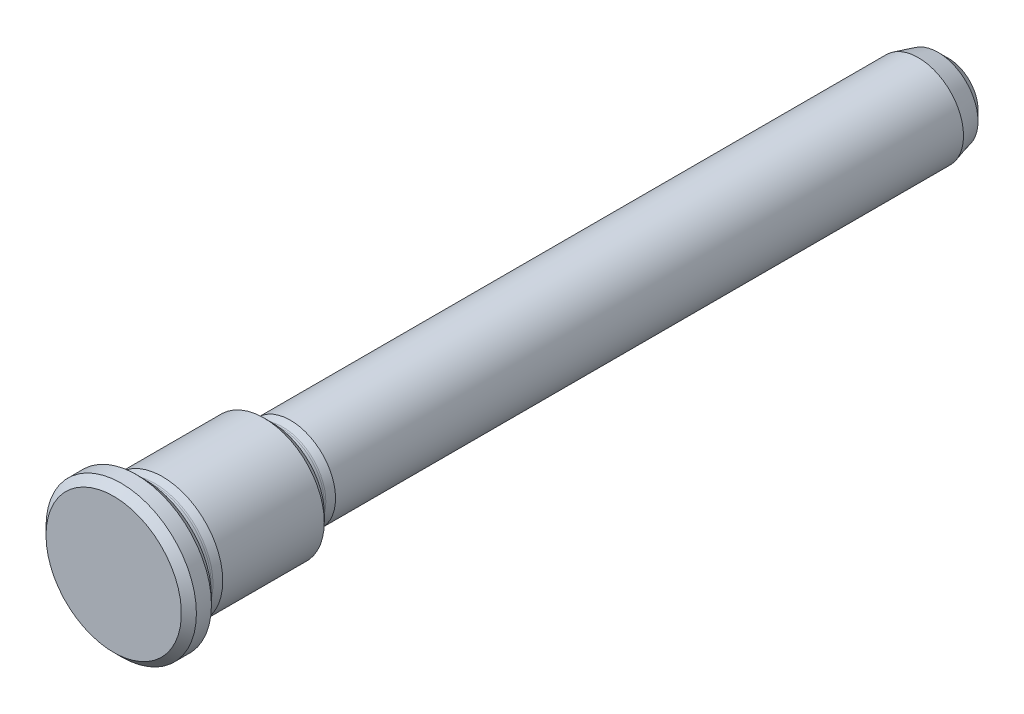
ISO-10303-21;
HEADER;
FILE_DESCRIPTION(('STEP AP214'),'2;1');
FILE_NAME('part.step','',(''),(''),'','','');
FILE_SCHEMA(('AUTOMOTIVE_DESIGN { 1 0 10303 214 1 1 1 1 }'));
ENDSEC;
DATA;
#1=APPLICATION_CONTEXT('core data for automotive mechanical design processes');
#2=APPLICATION_PROTOCOL_DEFINITION('international standard','automotive_design',2000,#1);
#3=PRODUCT_CONTEXT('',#1,'mechanical');
#4=PRODUCT('Part','Part','',(#3));
#5=PRODUCT_RELATED_PRODUCT_CATEGORY('part','',(#4));
#6=PRODUCT_DEFINITION_FORMATION('','',#4);
#7=PRODUCT_DEFINITION_CONTEXT('part definition',#1,'design');
#8=PRODUCT_DEFINITION('design','',#6,#7);
#9=PRODUCT_DEFINITION_SHAPE('','',#8);
#10=(LENGTH_UNIT() NAMED_UNIT(*) SI_UNIT(.MILLI.,.METRE.));
#11=(NAMED_UNIT(*) PLANE_ANGLE_UNIT() SI_UNIT($,.RADIAN.));
#12=(NAMED_UNIT(*) SI_UNIT($,.STERADIAN.) SOLID_ANGLE_UNIT());
#13=UNCERTAINTY_MEASURE_WITH_UNIT(LENGTH_MEASURE(1.E-05),#10,'distance_accuracy_value','');
#14=(GEOMETRIC_REPRESENTATION_CONTEXT(3) GLOBAL_UNCERTAINTY_ASSIGNED_CONTEXT((#13)) GLOBAL_UNIT_ASSIGNED_CONTEXT((#10,
#11,#12)) REPRESENTATION_CONTEXT('',''));
#15=CARTESIAN_POINT('',(0.,0.,0.));
#16=DIRECTION('',(0.,0.,1.));
#17=DIRECTION('',(1.,0.,0.));
#18=AXIS2_PLACEMENT_3D('',#15,#16,#17);
#19=CARTESIAN_POINT('',(0.,0.,0.));
#20=DIRECTION('',(0.,0.,-1.));
#21=DIRECTION('',(-1.,0.,0.));
#22=AXIS2_PLACEMENT_3D('',#19,#20,#21);
#23=PLANE('',#22);
#24=CARTESIAN_POINT('',(0.,0.,0.));
#25=DIRECTION('',(0.,0.,-1.));
#26=DIRECTION('',(-1.,0.,0.));
#27=AXIS2_PLACEMENT_3D('',#24,#25,#26);
#28=CIRCLE('',#27,9.);
#29=CARTESIAN_POINT('',(-9.,0.,0.));
#30=VERTEX_POINT('',#29);
#31=EDGE_CURVE('E9',#30,#30,#28,.F.);
#32=ORIENTED_EDGE('',*,*,#31,.T.);
#33=EDGE_LOOP('',(#32));
#34=FACE_BOUND('',#33,.T.);
#35=ADVANCED_FACE('F14',(#34),#23,.F.);
#36=CARTESIAN_POINT('',(0.,0.,0.));
#37=DIRECTION('',(0.,0.,1.));
#38=DIRECTION('',(1.,0.,0.));
#39=AXIS2_PLACEMENT_3D('',#36,#37,#38);
#40=CYLINDRICAL_SURFACE('',#39,10.);
#41=CARTESIAN_POINT('',(0.,0.,-3.));
#42=DIRECTION('',(0.,0.,1.));
#43=DIRECTION('',(1.,0.,0.));
#44=AXIS2_PLACEMENT_3D('',#41,#42,#43);
#45=CIRCLE('',#44,10.);
#46=CARTESIAN_POINT('',(10.,0.,-3.));
#47=VERTEX_POINT('',#46);
#48=EDGE_CURVE('E25',#47,#47,#45,.T.);
#49=ORIENTED_EDGE('',*,*,#48,.T.);
#50=EDGE_LOOP('',(#49));
#51=FACE_BOUND('',#50,.T.);
#52=CARTESIAN_POINT('',(0.,0.,-1.00000000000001));
#53=DIRECTION('',(0.,0.,-1.));
#54=DIRECTION('',(-1.,0.,0.));
#55=AXIS2_PLACEMENT_3D('',#52,#53,#54);
#56=CIRCLE('',#55,10.);
#57=CARTESIAN_POINT('',(-10.,0.,-1.00000000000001));
#58=VERTEX_POINT('',#57);
#59=EDGE_CURVE('E29',#58,#58,#56,.T.);
#60=ORIENTED_EDGE('',*,*,#59,.T.);
#61=EDGE_LOOP('',(#60));
#62=FACE_BOUND('',#61,.T.);
#63=ADVANCED_FACE('F100',(#51,#62),#40,.T.);
#64=CARTESIAN_POINT('',(0.,10.,-4.));
#65=DIRECTION('',(0.,0.,1.));
#66=DIRECTION('',(1.,0.,0.));
#67=AXIS2_PLACEMENT_3D('',#64,#65,#66);
#68=PLANE('',#67);
#69=CARTESIAN_POINT('',(0.,0.,-4.));
#70=DIRECTION('',(0.,0.,1.));
#71=DIRECTION('',(1.,0.,0.));
#72=AXIS2_PLACEMENT_3D('',#69,#70,#71);
#73=CIRCLE('',#72,9.);
#74=CARTESIAN_POINT('',(9.,0.,-4.));
#75=VERTEX_POINT('',#74);
#76=EDGE_CURVE('E21',#75,#75,#73,.F.);
#77=ORIENTED_EDGE('',*,*,#76,.T.);
#78=EDGE_LOOP('',(#77));
#79=FACE_BOUND('',#78,.T.);
#80=CARTESIAN_POINT('',(0.,0.,-4.));
#81=DIRECTION('',(0.,0.,1.));
#82=DIRECTION('',(1.,0.,0.));
#83=AXIS2_PLACEMENT_3D('',#80,#81,#82);
#84=CIRCLE('',#83,8.5);
#85=CARTESIAN_POINT('',(8.5,0.,-4.));
#86=VERTEX_POINT('',#85);
#87=EDGE_CURVE('E46',#86,#86,#84,.T.);
#88=ORIENTED_EDGE('',*,*,#87,.T.);
#89=EDGE_LOOP('',(#88));
#90=FACE_BOUND('',#89,.T.);
#91=ADVANCED_FACE('F106',(#79,#90),#68,.F.);
#92=CARTESIAN_POINT('',(0.,0.,-4.8));
#93=DIRECTION('',(0.,0.,1.));
#94=DIRECTION('',(1.,0.,0.));
#95=AXIS2_PLACEMENT_3D('',#92,#93,#94);
#96=TOROIDAL_SURFACE('',#95,8.5,0.8);
#97=ORIENTED_EDGE('',*,*,#87,.F.);
#98=EDGE_LOOP('',(#97));
#99=FACE_BOUND('',#98,.T.);
#100=CARTESIAN_POINT('',(0.,0.,-4.8));
#101=DIRECTION('',(0.,0.,1.));
#102=DIRECTION('',(1.,0.,0.));
#103=AXIS2_PLACEMENT_3D('',#100,#101,#102);
#104=CIRCLE('',#103,7.7);
#105=CARTESIAN_POINT('',(7.7,0.,-4.8));
#106=VERTEX_POINT('',#105);
#107=EDGE_CURVE('E49',#106,#106,#104,.T.);
#108=ORIENTED_EDGE('',*,*,#107,.T.);
#109=EDGE_LOOP('',(#108));
#110=FACE_BOUND('',#109,.T.);
#111=ADVANCED_FACE('F176',(#99,#110),#96,.F.);
#112=CARTESIAN_POINT('',(0.,0.,0.));
#113=DIRECTION('',(0.,0.,1.));
#114=DIRECTION('',(1.,0.,0.));
#115=AXIS2_PLACEMENT_3D('',#112,#113,#114);
#116=CYLINDRICAL_SURFACE('',#115,7.7);
#117=ORIENTED_EDGE('',*,*,#107,.F.);
#118=EDGE_LOOP('',(#117));
#119=FACE_BOUND('',#118,.T.);
#120=CARTESIAN_POINT('',(0.,0.,-5.27506275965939));
#121=DIRECTION('',(0.,0.,1.));
#122=DIRECTION('',(1.,0.,0.));
#123=AXIS2_PLACEMENT_3D('',#120,#121,#122);
#124=CIRCLE('',#123,7.7);
#125=CARTESIAN_POINT('',(7.7,0.,-5.27506275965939));
#126=VERTEX_POINT('',#125);
#127=EDGE_CURVE('E52',#126,#126,#124,.T.);
#128=ORIENTED_EDGE('',*,*,#127,.T.);
#129=EDGE_LOOP('',(#128));
#130=FACE_BOUND('',#129,.T.);
#131=ADVANCED_FACE('F232',(#119,#130),#116,.T.);
#132=CARTESIAN_POINT('',(0.,0.,-5.27506275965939));
#133=DIRECTION('',(0.,0.,1.));
#134=DIRECTION('',(1.,0.,0.));
#135=AXIS2_PLACEMENT_3D('',#132,#133,#134);
#136=TOROIDAL_SURFACE('',#135,8.5,0.8);
#137=ORIENTED_EDGE('',*,*,#127,.F.);
#138=EDGE_LOOP('',(#137));
#139=FACE_BOUND('',#138,.T.);
#140=CARTESIAN_POINT('',(0.,0.,-5.4821179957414));
#141=DIRECTION('',(0.,0.,1.));
#142=DIRECTION('',(1.,0.,0.));
#143=AXIS2_PLACEMENT_3D('',#140,#141,#142);
#144=CIRCLE('',#143,7.72725933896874);
#145=CARTESIAN_POINT('',(7.72725933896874,0.,-5.4821179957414));
#146=VERTEX_POINT('',#145);
#147=EDGE_CURVE('E55',#146,#146,#144,.T.);
#148=ORIENTED_EDGE('',*,*,#147,.T.);
#149=EDGE_LOOP('',(#148));
#150=FACE_BOUND('',#149,.T.);
#151=ADVANCED_FACE('F222',(#139,#150),#136,.F.);
#152=CARTESIAN_POINT('',(0.,0.,-6.5));
#153=DIRECTION('',(0.,0.,-1.));
#154=DIRECTION('',(-1.,0.,0.));
#155=AXIS2_PLACEMENT_3D('',#152,#153,#154);
#156=CONICAL_SURFACE('',#155,8.,0.261799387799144);
#157=ORIENTED_EDGE('',*,*,#147,.F.);
#158=EDGE_LOOP('',(#157));
#159=FACE_BOUND('',#158,.T.);
#160=CARTESIAN_POINT('',(0.,0.,-6.5));
#161=DIRECTION('',(0.,0.,1.));
#162=DIRECTION('',(1.,0.,0.));
#163=AXIS2_PLACEMENT_3D('',#160,#161,#162);
#164=CIRCLE('',#163,8.);
#165=CARTESIAN_POINT('',(8.,0.,-6.5));
#166=VERTEX_POINT('',#165);
#167=EDGE_CURVE('E58',#166,#166,#164,.T.);
#168=ORIENTED_EDGE('',*,*,#167,.T.);
#169=EDGE_LOOP('',(#168));
#170=FACE_BOUND('',#169,.T.);
#171=ADVANCED_FACE('F164',(#159,#170),#156,.T.);
#172=CARTESIAN_POINT('',(0.,0.,0.));
#173=DIRECTION('',(0.,0.,1.));
#174=DIRECTION('',(1.,0.,0.));
#175=AXIS2_PLACEMENT_3D('',#172,#173,#174);
#176=CYLINDRICAL_SURFACE('',#175,8.);
#177=CARTESIAN_POINT('',(0.,0.,-20.));
#178=DIRECTION('',(0.,0.,1.));
#179=DIRECTION('',(1.,0.,0.));
#180=AXIS2_PLACEMENT_3D('',#177,#178,#179);
#181=CIRCLE('',#180,8.);
#182=CARTESIAN_POINT('',(8.,0.,-20.));
#183=VERTEX_POINT('',#182);
#184=EDGE_CURVE('E37',#183,#183,#181,.T.);
#185=ORIENTED_EDGE('',*,*,#184,.T.);
#186=EDGE_LOOP('',(#185));
#187=FACE_BOUND('',#186,.T.);
#188=ORIENTED_EDGE('',*,*,#167,.F.);
#189=EDGE_LOOP('',(#188));
#190=FACE_BOUND('',#189,.T.);
#191=ADVANCED_FACE('F152',(#187,#190),#176,.T.);
#192=CARTESIAN_POINT('',(0.,8.,-21.));
#193=DIRECTION('',(0.,0.,1.));
#194=DIRECTION('',(1.,0.,0.));
#195=AXIS2_PLACEMENT_3D('',#192,#193,#194);
#196=PLANE('',#195);
#197=CARTESIAN_POINT('',(0.,0.,-21.));
#198=DIRECTION('',(0.,0.,1.));
#199=DIRECTION('',(1.,0.,0.));
#200=AXIS2_PLACEMENT_3D('',#197,#198,#199);
#201=CIRCLE('',#200,7.);
#202=CARTESIAN_POINT('',(7.,0.,-21.));
#203=VERTEX_POINT('',#202);
#204=EDGE_CURVE('E34',#203,#203,#201,.F.);
#205=ORIENTED_EDGE('',*,*,#204,.T.);
#206=EDGE_LOOP('',(#205));
#207=FACE_BOUND('',#206,.T.);
#208=CARTESIAN_POINT('',(0.,0.,-21.));
#209=DIRECTION('',(0.,0.,1.));
#210=DIRECTION('',(1.,0.,0.));
#211=AXIS2_PLACEMENT_3D('',#208,#209,#210);
#212=CIRCLE('',#211,6.5);
#213=CARTESIAN_POINT('',(6.5,0.,-21.));
#214=VERTEX_POINT('',#213);
#215=EDGE_CURVE('E61',#214,#214,#212,.T.);
#216=ORIENTED_EDGE('',*,*,#215,.T.);
#217=EDGE_LOOP('',(#216));
#218=FACE_BOUND('',#217,.T.);
#219=ADVANCED_FACE('F146',(#207,#218),#196,.F.);
#220=CARTESIAN_POINT('',(0.,0.,-21.8));
#221=DIRECTION('',(0.,0.,1.));
#222=DIRECTION('',(1.,0.,0.));
#223=AXIS2_PLACEMENT_3D('',#220,#221,#222);
#224=TOROIDAL_SURFACE('',#223,6.5,0.8);
#225=ORIENTED_EDGE('',*,*,#215,.F.);
#226=EDGE_LOOP('',(#225));
#227=FACE_BOUND('',#226,.T.);
#228=CARTESIAN_POINT('',(0.,0.,-21.8));
#229=DIRECTION('',(0.,0.,1.));
#230=DIRECTION('',(1.,0.,0.));
#231=AXIS2_PLACEMENT_3D('',#228,#229,#230);
#232=CIRCLE('',#231,5.7);
#233=CARTESIAN_POINT('',(5.7,0.,-21.8));
#234=VERTEX_POINT('',#233);
#235=EDGE_CURVE('E64',#234,#234,#232,.T.);
#236=ORIENTED_EDGE('',*,*,#235,.T.);
#237=EDGE_LOOP('',(#236));
#238=FACE_BOUND('',#237,.T.);
#239=ADVANCED_FACE('F151',(#227,#238),#224,.F.);
#240=CARTESIAN_POINT('',(0.,0.,0.));
#241=DIRECTION('',(0.,0.,1.));
#242=DIRECTION('',(1.,0.,0.));
#243=AXIS2_PLACEMENT_3D('',#240,#241,#242);
#244=CYLINDRICAL_SURFACE('',#243,5.7);
#245=ORIENTED_EDGE('',*,*,#235,.F.);
#246=EDGE_LOOP('',(#245));
#247=FACE_BOUND('',#246,.T.);
#248=CARTESIAN_POINT('',(0.,0.,-22.2750627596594));
#249=DIRECTION('',(0.,0.,1.));
#250=DIRECTION('',(1.,0.,0.));
#251=AXIS2_PLACEMENT_3D('',#248,#249,#250);
#252=CIRCLE('',#251,5.7);
#253=CARTESIAN_POINT('',(5.7,0.,-22.2750627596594));
#254=VERTEX_POINT('',#253);
#255=EDGE_CURVE('E67',#254,#254,#252,.T.);
#256=ORIENTED_EDGE('',*,*,#255,.T.);
#257=EDGE_LOOP('',(#256));
#258=FACE_BOUND('',#257,.T.);
#259=ADVANCED_FACE('F198',(#247,#258),#244,.T.);
#260=CARTESIAN_POINT('',(0.,0.,-22.2750627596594));
#261=DIRECTION('',(0.,0.,1.));
#262=DIRECTION('',(1.,0.,0.));
#263=AXIS2_PLACEMENT_3D('',#260,#261,#262);
#264=TOROIDAL_SURFACE('',#263,6.5,0.8);
#265=ORIENTED_EDGE('',*,*,#255,.F.);
#266=EDGE_LOOP('',(#265));
#267=FACE_BOUND('',#266,.T.);
#268=CARTESIAN_POINT('',(0.,0.,-22.4821179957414));
#269=DIRECTION('',(0.,0.,1.));
#270=DIRECTION('',(1.,0.,0.));
#271=AXIS2_PLACEMENT_3D('',#268,#269,#270);
#272=CIRCLE('',#271,5.72725933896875);
#273=CARTESIAN_POINT('',(5.72725933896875,0.,-22.4821179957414));
#274=VERTEX_POINT('',#273);
#275=EDGE_CURVE('E70',#274,#274,#272,.T.);
#276=ORIENTED_EDGE('',*,*,#275,.T.);
#277=EDGE_LOOP('',(#276));
#278=FACE_BOUND('',#277,.T.);
#279=ADVANCED_FACE('F187',(#267,#278),#264,.F.);
#280=CARTESIAN_POINT('',(0.,0.,-23.5));
#281=DIRECTION('',(0.,0.,-1.));
#282=DIRECTION('',(-1.,0.,0.));
#283=AXIS2_PLACEMENT_3D('',#280,#281,#282);
#284=CONICAL_SURFACE('',#283,6.,0.261799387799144);
#285=ORIENTED_EDGE('',*,*,#275,.F.);
#286=EDGE_LOOP('',(#285));
#287=FACE_BOUND('',#286,.T.);
#288=CARTESIAN_POINT('',(0.,0.,-23.5));
#289=DIRECTION('',(0.,0.,1.));
#290=DIRECTION('',(1.,0.,0.));
#291=AXIS2_PLACEMENT_3D('',#288,#289,#290);
#292=CIRCLE('',#291,6.);
#293=CARTESIAN_POINT('',(6.,0.,-23.5));
#294=VERTEX_POINT('',#293);
#295=EDGE_CURVE('E73',#294,#294,#292,.T.);
#296=ORIENTED_EDGE('',*,*,#295,.T.);
#297=EDGE_LOOP('',(#296));
#298=FACE_BOUND('',#297,.T.);
#299=ADVANCED_FACE('F96',(#287,#298),#284,.T.);
#300=CARTESIAN_POINT('',(0.,0.,0.));
#301=DIRECTION('',(0.,0.,1.));
#302=DIRECTION('',(1.,0.,0.));
#303=AXIS2_PLACEMENT_3D('',#300,#301,#302);
#304=CYLINDRICAL_SURFACE('',#303,6.);
#305=ORIENTED_EDGE('',*,*,#295,.F.);
#306=EDGE_LOOP('',(#305));
#307=FACE_BOUND('',#306,.T.);
#308=CARTESIAN_POINT('',(0.,0.,-107.));
#309=DIRECTION('',(0.,0.,1.));
#310=DIRECTION('',(1.,0.,0.));
#311=AXIS2_PLACEMENT_3D('',#308,#309,#310);
#312=CIRCLE('',#311,6.);
#313=CARTESIAN_POINT('',(6.,0.,-107.));
#314=VERTEX_POINT('',#313);
#315=EDGE_CURVE('E76',#314,#314,#312,.T.);
#316=ORIENTED_EDGE('',*,*,#315,.T.);
#317=EDGE_LOOP('',(#316));
#318=FACE_BOUND('',#317,.T.);
#319=ADVANCED_FACE('F80',(#307,#318),#304,.T.);
#320=CARTESIAN_POINT('',(0.,0.,-111.));
#321=DIRECTION('',(0.,0.,1.));
#322=DIRECTION('',(1.,0.,0.));
#323=AXIS2_PLACEMENT_3D('',#320,#321,#322);
#324=CONICAL_SURFACE('',#323,4.92820323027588,0.261799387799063);
#325=CARTESIAN_POINT('',(0.,0.,-109.633974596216));
#326=DIRECTION('',(0.,0.,-1.));
#327=DIRECTION('',(-1.,0.,0.));
#328=AXIS2_PLACEMENT_3D('',#325,#326,#327);
#329=CIRCLE('',#328,5.29422863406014);
#330=CARTESIAN_POINT('',(-5.29422863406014,0.,-109.633974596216));
#331=VERTEX_POINT('',#330);
#332=EDGE_CURVE('E43',#331,#331,#329,.F.);
#333=ORIENTED_EDGE('',*,*,#332,.T.);
#334=EDGE_LOOP('',(#333));
#335=FACE_BOUND('',#334,.T.);
#336=ORIENTED_EDGE('',*,*,#315,.F.);
#337=EDGE_LOOP('',(#336));
#338=FACE_BOUND('',#337,.T.);
#339=ADVANCED_FACE('F82',(#335,#338),#324,.T.);
#340=CARTESIAN_POINT('',(0.,4.92820323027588,-111.));
#341=DIRECTION('',(0.,0.,1.));
#342=DIRECTION('',(1.,0.,0.));
#343=AXIS2_PLACEMENT_3D('',#340,#341,#342);
#344=PLANE('',#343);
#345=CARTESIAN_POINT('',(0.,0.,-111.));
#346=DIRECTION('',(0.,0.,1.));
#347=DIRECTION('',(1.,0.,0.));
#348=AXIS2_PLACEMENT_3D('',#345,#346,#347);
#349=CIRCLE('',#348,3.9282032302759);
#350=CARTESIAN_POINT('',(3.9282032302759,0.,-111.));
#351=VERTEX_POINT('',#350);
#352=EDGE_CURVE('E40',#351,#351,#349,.F.);
#353=ORIENTED_EDGE('',*,*,#352,.T.);
#354=EDGE_LOOP('',(#353));
#355=FACE_BOUND('',#354,.T.);
#356=ADVANCED_FACE('F84',(#355),#344,.F.);
#357=CARTESIAN_POINT('',(0.,0.,-109.633974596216));
#358=DIRECTION('',(0.,0.,1.));
#359=DIRECTION('',(1.,0.,0.));
#360=AXIS2_PLACEMENT_3D('',#357,#358,#359);
#361=CONICAL_SURFACE('',#360,5.29422863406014,0.785398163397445);
#362=ORIENTED_EDGE('',*,*,#352,.F.);
#363=EDGE_LOOP('',(#362));
#364=FACE_BOUND('',#363,.T.);
#365=ORIENTED_EDGE('',*,*,#332,.F.);
#366=EDGE_LOOP('',(#365));
#367=FACE_BOUND('',#366,.T.);
#368=ADVANCED_FACE('F93',(#364,#367),#361,.T.);
#369=CARTESIAN_POINT('',(0.,0.,-20.));
#370=DIRECTION('',(0.,0.,1.));
#371=DIRECTION('',(1.,0.,0.));
#372=AXIS2_PLACEMENT_3D('',#369,#370,#371);
#373=CONICAL_SURFACE('',#372,8.,0.785398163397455);
#374=ORIENTED_EDGE('',*,*,#204,.F.);
#375=EDGE_LOOP('',(#374));
#376=FACE_BOUND('',#375,.T.);
#377=ORIENTED_EDGE('',*,*,#184,.F.);
#378=EDGE_LOOP('',(#377));
#379=FACE_BOUND('',#378,.T.);
#380=ADVANCED_FACE('F113',(#376,#379),#373,.T.);
#381=CARTESIAN_POINT('',(0.,0.,-3.));
#382=DIRECTION('',(0.,0.,1.));
#383=DIRECTION('',(1.,0.,0.));
#384=AXIS2_PLACEMENT_3D('',#381,#382,#383);
#385=CONICAL_SURFACE('',#384,10.,0.785398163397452);
#386=ORIENTED_EDGE('',*,*,#76,.F.);
#387=EDGE_LOOP('',(#386));
#388=FACE_BOUND('',#387,.T.);
#389=ORIENTED_EDGE('',*,*,#48,.F.);
#390=EDGE_LOOP('',(#389));
#391=FACE_BOUND('',#390,.T.);
#392=ADVANCED_FACE('F116',(#388,#391),#385,.T.);
#393=CARTESIAN_POINT('',(0.,0.,0.));
#394=DIRECTION('',(0.,0.,-1.));
#395=DIRECTION('',(-1.,0.,0.));
#396=AXIS2_PLACEMENT_3D('',#393,#394,#395);
#397=CONICAL_SURFACE('',#396,9.,0.785398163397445);
#398=ORIENTED_EDGE('',*,*,#59,.F.);
#399=EDGE_LOOP('',(#398));
#400=FACE_BOUND('',#399,.T.);
#401=ORIENTED_EDGE('',*,*,#31,.F.);
#402=EDGE_LOOP('',(#401));
#403=FACE_BOUND('',#402,.T.);
#404=ADVANCED_FACE('F16',(#400,#403),#397,.T.);
#405=CLOSED_SHELL('',(#35,#63,#91,#111,#131,#151,#171,#191,#219,#239,#259,#279,#299,#319,#339,
#356,#368,#380,#392,#404));
#406=MANIFOLD_SOLID_BREP('B1',#405);
#407=ADVANCED_BREP_SHAPE_REPRESENTATION('',(#18,#406),#14);
#408=SHAPE_DEFINITION_REPRESENTATION(#9,#407);
ENDSEC;
END-ISO-10303-21;
